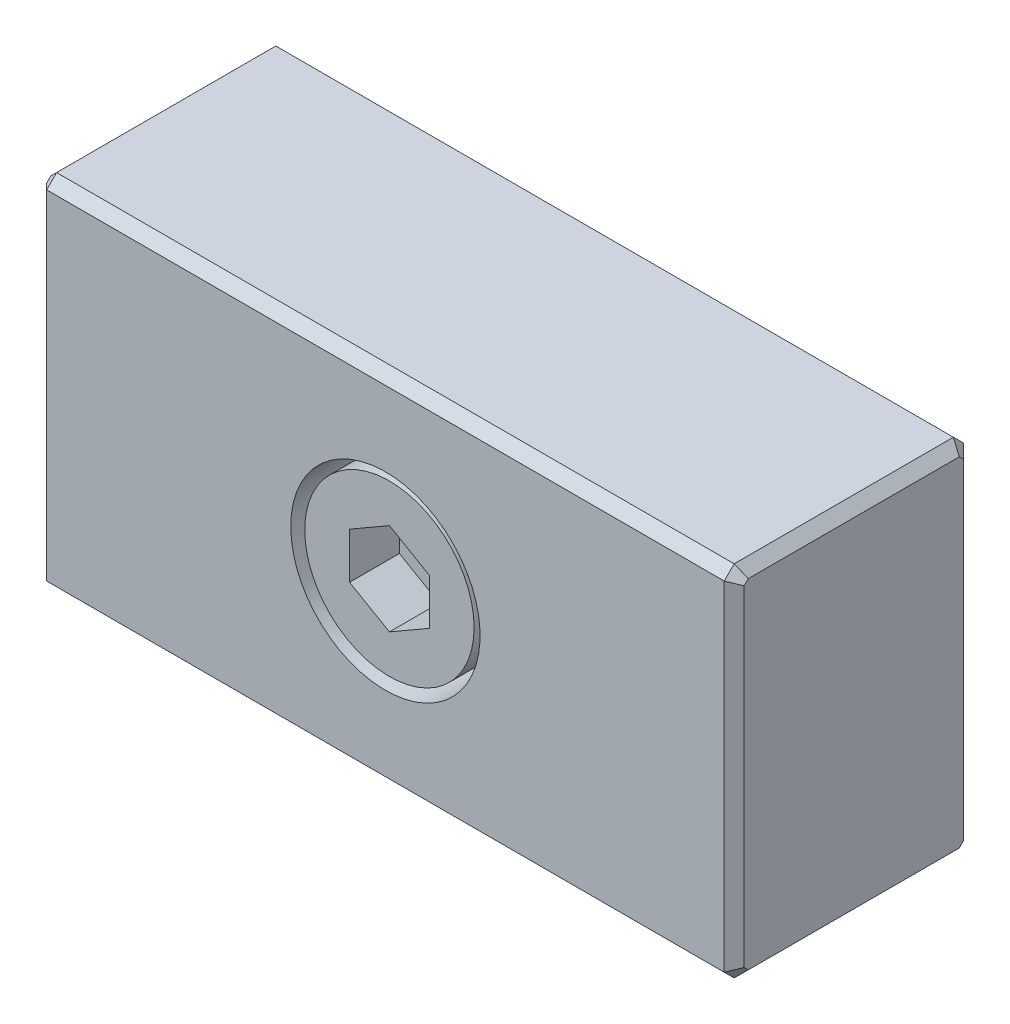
ISO-10303-21;
HEADER;
FILE_DESCRIPTION(('STEP AP214'),'2;1');
FILE_NAME('part.step','',(''),(''),'','','');
FILE_SCHEMA(('AUTOMOTIVE_DESIGN { 1 0 10303 214 1 1 1 1 }'));
ENDSEC;
DATA;
#1=APPLICATION_CONTEXT('core data for automotive mechanical design processes');
#2=APPLICATION_PROTOCOL_DEFINITION('international standard','automotive_design',2000,#1);
#3=PRODUCT_CONTEXT('',#1,'mechanical');
#4=PRODUCT('Part','Part','',(#3));
#5=PRODUCT_RELATED_PRODUCT_CATEGORY('part','',(#4));
#6=PRODUCT_DEFINITION_FORMATION('','',#4);
#7=PRODUCT_DEFINITION_CONTEXT('part definition',#1,'design');
#8=PRODUCT_DEFINITION('design','',#6,#7);
#9=PRODUCT_DEFINITION_SHAPE('','',#8);
#10=(LENGTH_UNIT() NAMED_UNIT(*) SI_UNIT(.MILLI.,.METRE.));
#11=(NAMED_UNIT(*) PLANE_ANGLE_UNIT() SI_UNIT($,.RADIAN.));
#12=(NAMED_UNIT(*) SI_UNIT($,.STERADIAN.) SOLID_ANGLE_UNIT());
#13=UNCERTAINTY_MEASURE_WITH_UNIT(LENGTH_MEASURE(1.E-05),#10,'distance_accuracy_value','');
#14=(GEOMETRIC_REPRESENTATION_CONTEXT(3) GLOBAL_UNCERTAINTY_ASSIGNED_CONTEXT((#13)) GLOBAL_UNIT_ASSIGNED_CONTEXT((#10,
#11,#12)) REPRESENTATION_CONTEXT('',''));
#15=CARTESIAN_POINT('',(0.,0.,0.));
#16=DIRECTION('',(0.,0.,1.));
#17=DIRECTION('',(1.,0.,0.));
#18=AXIS2_PLACEMENT_3D('',#15,#16,#17);
#19=CARTESIAN_POINT('',(17.5,6.5,12.));
#20=DIRECTION('',(0.,0.,-1.));
#21=DIRECTION('',(-1.,0.,0.));
#22=AXIS2_PLACEMENT_3D('',#19,#20,#21);
#23=PLANE('',#22);
#24=CARTESIAN_POINT('',(0.,0.,12.));
#25=DIRECTION('',(0.,0.,-1.));
#26=DIRECTION('',(-1.,0.,0.));
#27=AXIS2_PLACEMENT_3D('',#24,#25,#26);
#28=CIRCLE('',#27,4.75);
#29=CARTESIAN_POINT('',(-4.75,0.,12.));
#30=VERTEX_POINT('',#29);
#31=EDGE_CURVE('E367',#30,#30,#28,.T.);
#32=ORIENTED_EDGE('',*,*,#31,.T.);
#33=EDGE_LOOP('',(#32));
#34=FACE_BOUND('',#33,.T.);
#35=DIRECTION('',(1.,0.,0.));
#36=VECTOR('',#35,1.);
#37=CARTESIAN_POINT('',(-26.1878971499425,8.5,12.));
#38=LINE('',#37,#36);
#39=CARTESIAN_POINT('',(-17.,8.5,12.));
#40=VERTEX_POINT('',#39);
#41=CARTESIAN_POINT('',(17.,8.5,12.));
#42=VERTEX_POINT('',#41);
#43=EDGE_CURVE('E189',#40,#42,#38,.T.);
#44=ORIENTED_EDGE('',*,*,#43,.F.);
#45=DIRECTION('',(0.,-1.,0.));
#46=VECTOR('',#45,1.);
#47=CARTESIAN_POINT('',(-17.,-8.5,12.));
#48=LINE('',#47,#46);
#49=CARTESIAN_POINT('',(-17.,-8.5,12.));
#50=VERTEX_POINT('',#49);
#51=EDGE_CURVE('E269',#40,#50,#48,.T.);
#52=ORIENTED_EDGE('',*,*,#51,.T.);
#53=DIRECTION('',(1.,0.,0.));
#54=VECTOR('',#53,1.);
#55=CARTESIAN_POINT('',(-26.1878971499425,-8.5,12.));
#56=LINE('',#55,#54);
#57=CARTESIAN_POINT('',(17.,-8.5,12.));
#58=VERTEX_POINT('',#57);
#59=EDGE_CURVE('E765',#50,#58,#56,.T.);
#60=ORIENTED_EDGE('',*,*,#59,.T.);
#61=DIRECTION('',(0.,1.,0.));
#62=VECTOR('',#61,1.);
#63=CARTESIAN_POINT('',(17.,6.5,12.));
#64=LINE('',#63,#62);
#65=EDGE_CURVE('E267',#58,#42,#64,.T.);
#66=ORIENTED_EDGE('',*,*,#65,.T.);
#67=EDGE_LOOP('',(#44,#52,#60,#66));
#68=FACE_BOUND('',#67,.T.);
#69=ADVANCED_FACE('F14',(#34,#68),#23,.F.);
#70=CARTESIAN_POINT('',(17.5,-9.,4.8));
#71=DIRECTION('',(0.,1.,0.));
#72=DIRECTION('',(-1.,0.,0.));
#73=AXIS2_PLACEMENT_3D('',#70,#71,#72);
#74=PLANE('',#73);
#75=DIRECTION('',(1.,0.,0.));
#76=VECTOR('',#75,1.);
#77=CARTESIAN_POINT('',(-26.1878971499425,-9.,11.5));
#78=LINE('',#77,#76);
#79=CARTESIAN_POINT('',(-17.,-9.,11.5));
#80=VERTEX_POINT('',#79);
#81=CARTESIAN_POINT('',(17.,-9.,11.5));
#82=VERTEX_POINT('',#81);
#83=EDGE_CURVE('E318',#80,#82,#78,.T.);
#84=ORIENTED_EDGE('',*,*,#83,.F.);
#85=DIRECTION('',(0.,0.,-1.));
#86=VECTOR('',#85,1.);
#87=CARTESIAN_POINT('',(-17.,-9.,0.5));
#88=LINE('',#87,#86);
#89=CARTESIAN_POINT('',(-17.,-9.,0.5));
#90=VERTEX_POINT('',#89);
#91=EDGE_CURVE('E278',#80,#90,#88,.T.);
#92=ORIENTED_EDGE('',*,*,#91,.T.);
#93=DIRECTION('',(-1.,0.,0.));
#94=VECTOR('',#93,1.);
#95=CARTESIAN_POINT('',(17.5,-9.,0.5));
#96=LINE('',#95,#94);
#97=CARTESIAN_POINT('',(17.,-9.,0.5));
#98=VERTEX_POINT('',#97);
#99=EDGE_CURVE('E365',#98,#90,#96,.T.);
#100=ORIENTED_EDGE('',*,*,#99,.F.);
#101=DIRECTION('',(0.,0.,1.));
#102=VECTOR('',#101,1.);
#103=CARTESIAN_POINT('',(17.,-9.,4.8));
#104=LINE('',#103,#102);
#105=EDGE_CURVE('E276',#98,#82,#104,.T.);
#106=ORIENTED_EDGE('',*,*,#105,.T.);
#107=EDGE_LOOP('',(#84,#92,#100,#106));
#108=FACE_BOUND('',#107,.T.);
#109=ADVANCED_FACE('F710',(#108),#74,.F.);
#110=CARTESIAN_POINT('',(17.5,-9.,0.5));
#111=DIRECTION('',(0.,0.707106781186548,0.707106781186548));
#112=DIRECTION('',(0.,-0.707106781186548,0.707106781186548));
#113=AXIS2_PLACEMENT_3D('',#110,#111,#112);
#114=PLANE('',#113);
#115=ORIENTED_EDGE('',*,*,#99,.T.);
#116=DIRECTION('',(0.,0.707106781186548,-0.707106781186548));
#117=VECTOR('',#116,1.);
#118=CARTESIAN_POINT('',(-17.,-8.5,0.));
#119=LINE('',#118,#117);
#120=CARTESIAN_POINT('',(-17.,-8.5,0.));
#121=VERTEX_POINT('',#120);
#122=EDGE_CURVE('E282',#90,#121,#119,.T.);
#123=ORIENTED_EDGE('',*,*,#122,.T.);
#124=DIRECTION('',(-1.,0.,0.));
#125=VECTOR('',#124,1.);
#126=CARTESIAN_POINT('',(17.5,-8.5,0.));
#127=LINE('',#126,#125);
#128=CARTESIAN_POINT('',(17.,-8.5,0.));
#129=VERTEX_POINT('',#128);
#130=EDGE_CURVE('E363',#129,#121,#127,.T.);
#131=ORIENTED_EDGE('',*,*,#130,.F.);
#132=DIRECTION('',(0.,-0.707106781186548,0.707106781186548));
#133=VECTOR('',#132,1.);
#134=CARTESIAN_POINT('',(17.,-9.,0.5));
#135=LINE('',#134,#133);
#136=EDGE_CURVE('E280',#129,#98,#135,.T.);
#137=ORIENTED_EDGE('',*,*,#136,.T.);
#138=EDGE_LOOP('',(#115,#123,#131,#137));
#139=FACE_BOUND('',#138,.T.);
#140=ADVANCED_FACE('F701',(#139),#114,.F.);
#141=CARTESIAN_POINT('',(17.5,8.5,0.));
#142=DIRECTION('',(0.,0.,1.));
#143=DIRECTION('',(1.,0.,0.));
#144=AXIS2_PLACEMENT_3D('',#141,#142,#143);
#145=PLANE('',#144);
#146=CARTESIAN_POINT('',(0.,0.,0.));
#147=DIRECTION('',(0.,0.,-1.));
#148=DIRECTION('',(-1.,0.,0.));
#149=AXIS2_PLACEMENT_3D('',#146,#147,#148);
#150=CIRCLE('',#149,2.75);
#151=CARTESIAN_POINT('',(-2.75,0.,0.));
#152=VERTEX_POINT('',#151);
#153=EDGE_CURVE('E231',#152,#152,#150,.T.);
#154=ORIENTED_EDGE('',*,*,#153,.F.);
#155=EDGE_LOOP('',(#154));
#156=FACE_BOUND('',#155,.T.);
#157=ORIENTED_EDGE('',*,*,#130,.T.);
#158=DIRECTION('',(0.,1.,0.));
#159=VECTOR('',#158,1.);
#160=CARTESIAN_POINT('',(-17.,8.5,0.));
#161=LINE('',#160,#159);
#162=CARTESIAN_POINT('',(-17.,8.5,0.));
#163=VERTEX_POINT('',#162);
#164=EDGE_CURVE('E234',#121,#163,#161,.T.);
#165=ORIENTED_EDGE('',*,*,#164,.T.);
#166=DIRECTION('',(-1.,0.,0.));
#167=VECTOR('',#166,1.);
#168=CARTESIAN_POINT('',(17.5,8.5,0.));
#169=LINE('',#168,#167);
#170=CARTESIAN_POINT('',(17.,8.5,0.));
#171=VERTEX_POINT('',#170);
#172=EDGE_CURVE('E355',#171,#163,#169,.T.);
#173=ORIENTED_EDGE('',*,*,#172,.F.);
#174=DIRECTION('',(0.,-1.,0.));
#175=VECTOR('',#174,1.);
#176=CARTESIAN_POINT('',(17.,8.5,0.));
#177=LINE('',#176,#175);
#178=EDGE_CURVE('E232',#171,#129,#177,.T.);
#179=ORIENTED_EDGE('',*,*,#178,.T.);
#180=EDGE_LOOP('',(#157,#165,#173,#179));
#181=FACE_BOUND('',#180,.T.);
#182=ADVANCED_FACE('F360',(#156,#181),#145,.F.);
#183=CARTESIAN_POINT('',(17.5,9.,0.5));
#184=DIRECTION('',(0.,-0.707106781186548,0.707106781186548));
#185=DIRECTION('',(0.,-0.707106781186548,-0.707106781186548));
#186=AXIS2_PLACEMENT_3D('',#183,#184,#185);
#187=PLANE('',#186);
#188=ORIENTED_EDGE('',*,*,#172,.T.);
#189=DIRECTION('',(0.,0.707106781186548,0.707106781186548));
#190=VECTOR('',#189,1.);
#191=CARTESIAN_POINT('',(-17.,9.,0.5));
#192=LINE('',#191,#190);
#193=CARTESIAN_POINT('',(-17.,9.,0.5));
#194=VERTEX_POINT('',#193);
#195=EDGE_CURVE('E257',#163,#194,#192,.T.);
#196=ORIENTED_EDGE('',*,*,#195,.T.);
#197=DIRECTION('',(-1.,0.,0.));
#198=VECTOR('',#197,1.);
#199=CARTESIAN_POINT('',(17.5,9.,0.5));
#200=LINE('',#199,#198);
#201=CARTESIAN_POINT('',(17.,9.,0.5));
#202=VERTEX_POINT('',#201);
#203=EDGE_CURVE('E357',#202,#194,#200,.T.);
#204=ORIENTED_EDGE('',*,*,#203,.F.);
#205=DIRECTION('',(0.,-0.707106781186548,-0.707106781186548));
#206=VECTOR('',#205,1.);
#207=CARTESIAN_POINT('',(17.,9.,0.5));
#208=LINE('',#207,#206);
#209=EDGE_CURVE('E255',#202,#171,#208,.T.);
#210=ORIENTED_EDGE('',*,*,#209,.T.);
#211=EDGE_LOOP('',(#188,#196,#204,#210));
#212=FACE_BOUND('',#211,.T.);
#213=ADVANCED_FACE('F354',(#212),#187,.F.);
#214=CARTESIAN_POINT('',(17.5,9.,4.8));
#215=DIRECTION('',(0.,-1.,0.));
#216=DIRECTION('',(1.,0.,0.));
#217=AXIS2_PLACEMENT_3D('',#214,#215,#216);
#218=PLANE('',#217);
#219=ORIENTED_EDGE('',*,*,#203,.T.);
#220=DIRECTION('',(0.,0.,1.));
#221=VECTOR('',#220,1.);
#222=CARTESIAN_POINT('',(-17.,9.,11.5));
#223=LINE('',#222,#221);
#224=CARTESIAN_POINT('',(-17.,9.,11.5));
#225=VERTEX_POINT('',#224);
#226=EDGE_CURVE('E261',#194,#225,#223,.T.);
#227=ORIENTED_EDGE('',*,*,#226,.T.);
#228=DIRECTION('',(1.,0.,0.));
#229=VECTOR('',#228,1.);
#230=CARTESIAN_POINT('',(-26.1878971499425,9.,11.5));
#231=LINE('',#230,#229);
#232=CARTESIAN_POINT('',(17.,9.,11.5));
#233=VERTEX_POINT('',#232);
#234=EDGE_CURVE('E192',#225,#233,#231,.T.);
#235=ORIENTED_EDGE('',*,*,#234,.T.);
#236=DIRECTION('',(0.,0.,-1.));
#237=VECTOR('',#236,1.);
#238=CARTESIAN_POINT('',(17.,9.,4.8));
#239=LINE('',#238,#237);
#240=EDGE_CURVE('E259',#233,#202,#239,.T.);
#241=ORIENTED_EDGE('',*,*,#240,.T.);
#242=EDGE_LOOP('',(#219,#227,#235,#241));
#243=FACE_BOUND('',#242,.T.);
#244=ADVANCED_FACE('F678',(#243),#218,.F.);
#245=CARTESIAN_POINT('',(17.5,13.5,5.00000000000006));
#246=DIRECTION('',(-1.,0.,0.));
#247=DIRECTION('',(0.,-1.,0.));
#248=AXIS2_PLACEMENT_3D('',#245,#246,#247);
#249=PLANE('',#248);
#250=DIRECTION('',(0.,-1.,0.));
#251=VECTOR('',#250,1.);
#252=CARTESIAN_POINT('',(17.5,13.5,11.5));
#253=LINE('',#252,#251);
#254=CARTESIAN_POINT('',(17.5,8.29289321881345,11.5));
#255=VERTEX_POINT('',#254);
#256=CARTESIAN_POINT('',(17.5,-8.29289321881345,11.5));
#257=VERTEX_POINT('',#256);
#258=EDGE_CURVE('E23',#255,#257,#253,.T.);
#259=ORIENTED_EDGE('',*,*,#258,.T.);
#260=DIRECTION('',(0.,-0.707106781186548,-0.707106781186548));
#261=VECTOR('',#260,1.);
#262=CARTESIAN_POINT('',(17.5,-8.64644660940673,11.1464466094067));
#263=LINE('',#262,#261);
#264=CARTESIAN_POINT('',(17.5,-8.5,11.2928932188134));
#265=VERTEX_POINT('',#264);
#266=EDGE_CURVE('E9',#257,#265,#263,.T.);
#267=ORIENTED_EDGE('',*,*,#266,.T.);
#268=DIRECTION('',(0.,0.,-1.));
#269=VECTOR('',#268,1.);
#270=CARTESIAN_POINT('',(17.5,-8.5,5.00000000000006));
#271=LINE('',#270,#269);
#272=CARTESIAN_POINT('',(17.5,-8.5,0.707106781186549));
#273=VERTEX_POINT('',#272);
#274=EDGE_CURVE('E284',#265,#273,#271,.T.);
#275=ORIENTED_EDGE('',*,*,#274,.T.);
#276=DIRECTION('',(0.,0.707106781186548,-0.707106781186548));
#277=VECTOR('',#276,1.);
#278=CARTESIAN_POINT('',(17.5,0.353553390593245,-8.1464466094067));
#279=LINE('',#278,#277);
#280=CARTESIAN_POINT('',(17.5,-8.29289321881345,0.5));
#281=VERTEX_POINT('',#280);
#282=EDGE_CURVE('E286',#273,#281,#279,.T.);
#283=ORIENTED_EDGE('',*,*,#282,.T.);
#284=DIRECTION('',(0.,1.,0.));
#285=VECTOR('',#284,1.);
#286=CARTESIAN_POINT('',(17.5,13.5,0.5));
#287=LINE('',#286,#285);
#288=CARTESIAN_POINT('',(17.5,8.29289321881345,0.5));
#289=VERTEX_POINT('',#288);
#290=EDGE_CURVE('E288',#281,#289,#287,.T.);
#291=ORIENTED_EDGE('',*,*,#290,.T.);
#292=DIRECTION('',(0.,0.707106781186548,0.707106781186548));
#293=VECTOR('',#292,1.);
#294=CARTESIAN_POINT('',(17.5,13.1464466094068,5.3535533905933));
#295=LINE('',#294,#293);
#296=CARTESIAN_POINT('',(17.5,8.5,0.707106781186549));
#297=VERTEX_POINT('',#296);
#298=EDGE_CURVE('E290',#289,#297,#295,.T.);
#299=ORIENTED_EDGE('',*,*,#298,.T.);
#300=DIRECTION('',(0.,0.,1.));
#301=VECTOR('',#300,1.);
#302=CARTESIAN_POINT('',(17.5,8.5,5.00000000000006));
#303=LINE('',#302,#301);
#304=CARTESIAN_POINT('',(17.5,8.5,11.2928932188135));
#305=VERTEX_POINT('',#304);
#306=EDGE_CURVE('E292',#297,#305,#303,.T.);
#307=ORIENTED_EDGE('',*,*,#306,.T.);
#308=DIRECTION('',(0.,-0.707106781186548,0.707106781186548));
#309=VECTOR('',#308,1.);
#310=CARTESIAN_POINT('',(17.5,8.14644660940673,11.6464466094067));
#311=LINE('',#310,#309);
#312=EDGE_CURVE('E34',#305,#255,#311,.T.);
#313=ORIENTED_EDGE('',*,*,#312,.T.);
#314=EDGE_LOOP('',(#259,#267,#275,#283,#291,#299,#307,#313));
#315=FACE_BOUND('',#314,.T.);
#316=ADVANCED_FACE('F669',(#315),#249,.F.);
#317=CARTESIAN_POINT('',(-17.5,13.5,5.00000000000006));
#318=DIRECTION('',(-1.,0.,0.));
#319=DIRECTION('',(0.,-1.,0.));
#320=AXIS2_PLACEMENT_3D('',#317,#318,#319);
#321=PLANE('',#320);
#322=DIRECTION('',(0.,-0.707106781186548,-0.707106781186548));
#323=VECTOR('',#322,1.);
#324=CARTESIAN_POINT('',(-17.5,8.14644660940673,0.353553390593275));
#325=LINE('',#324,#323);
#326=CARTESIAN_POINT('',(-17.5,8.5,0.707106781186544));
#327=VERTEX_POINT('',#326);
#328=CARTESIAN_POINT('',(-17.5,8.29289321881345,0.5));
#329=VERTEX_POINT('',#328);
#330=EDGE_CURVE('E250',#327,#329,#325,.T.);
#331=ORIENTED_EDGE('',*,*,#330,.T.);
#332=DIRECTION('',(0.,-1.,0.));
#333=VECTOR('',#332,1.);
#334=CARTESIAN_POINT('',(-17.5,-8.5,0.5));
#335=LINE('',#334,#333);
#336=CARTESIAN_POINT('',(-17.5,-8.29289321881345,0.5));
#337=VERTEX_POINT('',#336);
#338=EDGE_CURVE('E252',#329,#337,#335,.T.);
#339=ORIENTED_EDGE('',*,*,#338,.T.);
#340=DIRECTION('',(0.,-0.707106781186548,0.707106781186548));
#341=VECTOR('',#340,1.);
#342=CARTESIAN_POINT('',(-17.5,-8.64644660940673,0.853553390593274));
#343=LINE('',#342,#341);
#344=CARTESIAN_POINT('',(-17.5,-8.5,0.707106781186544));
#345=VERTEX_POINT('',#344);
#346=EDGE_CURVE('E238',#337,#345,#343,.T.);
#347=ORIENTED_EDGE('',*,*,#346,.T.);
#348=DIRECTION('',(0.,0.,1.));
#349=VECTOR('',#348,1.);
#350=CARTESIAN_POINT('',(-17.5,-8.5,11.5));
#351=LINE('',#350,#349);
#352=CARTESIAN_POINT('',(-17.5,-8.5,11.2928932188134));
#353=VERTEX_POINT('',#352);
#354=EDGE_CURVE('E240',#345,#353,#351,.T.);
#355=ORIENTED_EDGE('',*,*,#354,.T.);
#356=DIRECTION('',(0.,0.707106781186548,0.707106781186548));
#357=VECTOR('',#356,1.);
#358=CARTESIAN_POINT('',(-17.5,-0.646446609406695,19.1464466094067));
#359=LINE('',#358,#357);
#360=CARTESIAN_POINT('',(-17.5,-8.29289321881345,11.5));
#361=VERTEX_POINT('',#360);
#362=EDGE_CURVE('E242',#353,#361,#359,.T.);
#363=ORIENTED_EDGE('',*,*,#362,.T.);
#364=DIRECTION('',(0.,1.,0.));
#365=VECTOR('',#364,1.);
#366=CARTESIAN_POINT('',(-17.5,8.5,11.5));
#367=LINE('',#366,#365);
#368=CARTESIAN_POINT('',(-17.5,8.29289321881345,11.5));
#369=VERTEX_POINT('',#368);
#370=EDGE_CURVE('E244',#361,#369,#367,.T.);
#371=ORIENTED_EDGE('',*,*,#370,.T.);
#372=DIRECTION('',(0.,0.707106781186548,-0.707106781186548));
#373=VECTOR('',#372,1.);
#374=CARTESIAN_POINT('',(-17.5,14.1464466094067,5.64644660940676));
#375=LINE('',#374,#373);
#376=CARTESIAN_POINT('',(-17.5,8.5,11.2928932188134));
#377=VERTEX_POINT('',#376);
#378=EDGE_CURVE('E246',#369,#377,#375,.T.);
#379=ORIENTED_EDGE('',*,*,#378,.T.);
#380=DIRECTION('',(0.,0.,-1.));
#381=VECTOR('',#380,1.);
#382=CARTESIAN_POINT('',(-17.5,8.5,0.5));
#383=LINE('',#382,#381);
#384=EDGE_CURVE('E248',#377,#327,#383,.T.);
#385=ORIENTED_EDGE('',*,*,#384,.T.);
#386=EDGE_LOOP('',(#331,#339,#347,#355,#363,#371,#379,#385));
#387=FACE_BOUND('',#386,.T.);
#388=ADVANCED_FACE('F660',(#387),#321,.T.);
#389=CARTESIAN_POINT('',(0.,0.,0.));
#390=DIRECTION('',(0.,0.,-1.));
#391=DIRECTION('',(-1.,0.,0.));
#392=AXIS2_PLACEMENT_3D('',#389,#390,#391);
#393=CYLINDRICAL_SURFACE('',#392,4.75);
#394=ORIENTED_EDGE('',*,*,#31,.F.);
#395=EDGE_LOOP('',(#394));
#396=FACE_BOUND('',#395,.T.);
#397=CARTESIAN_POINT('',(0.,0.,6.8));
#398=DIRECTION('',(0.,0.,-1.));
#399=DIRECTION('',(-1.,0.,0.));
#400=AXIS2_PLACEMENT_3D('',#397,#398,#399);
#401=CIRCLE('',#400,4.75);
#402=CARTESIAN_POINT('',(-4.75,0.,6.8));
#403=VERTEX_POINT('',#402);
#404=EDGE_CURVE('E778',#403,#403,#401,.T.);
#405=ORIENTED_EDGE('',*,*,#404,.T.);
#406=EDGE_LOOP('',(#405));
#407=FACE_BOUND('',#406,.T.);
#408=ADVANCED_FACE('F651',(#396,#407),#393,.F.);
#409=CARTESIAN_POINT('',(0.,4.75,6.8));
#410=DIRECTION('',(0.,0.,-1.));
#411=DIRECTION('',(-1.,0.,0.));
#412=AXIS2_PLACEMENT_3D('',#409,#410,#411);
#413=PLANE('',#412);
#414=CARTESIAN_POINT('',(0.,0.,6.8));
#415=DIRECTION('',(0.,0.,-1.));
#416=DIRECTION('',(-1.,0.,0.));
#417=AXIS2_PLACEMENT_3D('',#414,#415,#416);
#418=CIRCLE('',#417,4.25);
#419=CARTESIAN_POINT('',(-4.25,0.,6.8));
#420=VERTEX_POINT('',#419);
#421=EDGE_CURVE('E235',#420,#420,#418,.T.);
#422=ORIENTED_EDGE('',*,*,#421,.T.);
#423=EDGE_LOOP('',(#422));
#424=FACE_BOUND('',#423,.T.);
#425=ORIENTED_EDGE('',*,*,#404,.F.);
#426=EDGE_LOOP('',(#425));
#427=FACE_BOUND('',#426,.T.);
#428=ADVANCED_FACE('F643',(#424,#427),#413,.F.);
#429=CARTESIAN_POINT('',(0.,0.,0.));
#430=DIRECTION('',(0.,0.,-1.));
#431=DIRECTION('',(-1.,0.,0.));
#432=AXIS2_PLACEMENT_3D('',#429,#430,#431);
#433=CYLINDRICAL_SURFACE('',#432,2.75);
#434=CARTESIAN_POINT('',(0.,0.,6.8));
#435=DIRECTION('',(0.,0.,-1.));
#436=DIRECTION('',(-1.,0.,0.));
#437=AXIS2_PLACEMENT_3D('',#434,#435,#436);
#438=CIRCLE('',#437,2.75);
#439=CARTESIAN_POINT('',(-2.75,0.,6.8));
#440=VERTEX_POINT('',#439);
#441=EDGE_CURVE('E775',#440,#440,#438,.T.);
#442=ORIENTED_EDGE('',*,*,#441,.F.);
#443=EDGE_LOOP('',(#442));
#444=FACE_BOUND('',#443,.T.);
#445=ORIENTED_EDGE('',*,*,#153,.T.);
#446=EDGE_LOOP('',(#445));
#447=FACE_BOUND('',#446,.T.);
#448=ADVANCED_FACE('F425',(#444,#447),#433,.F.);
#449=CARTESIAN_POINT('',(2.5,0.,-5.2));
#450=DIRECTION('',(0.,0.,-1.));
#451=DIRECTION('',(-1.,0.,0.));
#452=AXIS2_PLACEMENT_3D('',#449,#450,#451);
#453=PLANE('',#452);
#454=CARTESIAN_POINT('',(0.,0.,-5.2));
#455=DIRECTION('',(0.,0.,-1.));
#456=DIRECTION('',(-1.,0.,0.));
#457=AXIS2_PLACEMENT_3D('',#454,#455,#456);
#458=CIRCLE('',#457,1.6);
#459=CARTESIAN_POINT('',(-1.6,0.,-5.2));
#460=VERTEX_POINT('',#459);
#461=EDGE_CURVE('E228',#460,#460,#458,.T.);
#462=ORIENTED_EDGE('',*,*,#461,.T.);
#463=EDGE_LOOP('',(#462));
#464=FACE_BOUND('',#463,.T.);
#465=ADVANCED_FACE('F415',(#464),#453,.T.);
#466=CARTESIAN_POINT('',(0.,0.,-4.3));
#467=DIRECTION('',(0.,0.,1.));
#468=DIRECTION('',(1.,0.,0.));
#469=AXIS2_PLACEMENT_3D('',#466,#467,#468);
#470=CONICAL_SURFACE('',#469,2.5,0.785398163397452);
#471=ORIENTED_EDGE('',*,*,#461,.F.);
#472=EDGE_LOOP('',(#471));
#473=FACE_BOUND('',#472,.T.);
#474=CARTESIAN_POINT('',(0.,0.,-4.3));
#475=DIRECTION('',(0.,0.,-1.));
#476=DIRECTION('',(-1.,0.,0.));
#477=AXIS2_PLACEMENT_3D('',#474,#475,#476);
#478=CIRCLE('',#477,2.5);
#479=CARTESIAN_POINT('',(-2.5,0.,-4.3));
#480=VERTEX_POINT('',#479);
#481=EDGE_CURVE('E225',#480,#480,#478,.F.);
#482=ORIENTED_EDGE('',*,*,#481,.F.);
#483=EDGE_LOOP('',(#482));
#484=FACE_BOUND('',#483,.T.);
#485=ADVANCED_FACE('F413',(#473,#484),#470,.T.);
#486=CARTESIAN_POINT('',(0.,0.,14.8));
#487=DIRECTION('',(0.,0.,1.));
#488=DIRECTION('',(1.,0.,0.));
#489=AXIS2_PLACEMENT_3D('',#486,#487,#488);
#490=CYLINDRICAL_SURFACE('',#489,2.5);
#491=ORIENTED_EDGE('',*,*,#481,.T.);
#492=EDGE_LOOP('',(#491));
#493=FACE_BOUND('',#492,.T.);
#494=CARTESIAN_POINT('',(0.,0.,6.8));
#495=DIRECTION('',(0.,0.,1.));
#496=DIRECTION('',(1.,0.,0.));
#497=AXIS2_PLACEMENT_3D('',#494,#495,#496);
#498=CIRCLE('',#497,2.5);
#499=CARTESIAN_POINT('',(2.5,0.,6.8));
#500=VERTEX_POINT('',#499);
#501=EDGE_CURVE('E173',#500,#500,#498,.T.);
#502=ORIENTED_EDGE('',*,*,#501,.F.);
#503=EDGE_LOOP('',(#502));
#504=FACE_BOUND('',#503,.T.);
#505=ADVANCED_FACE('F406',(#493,#504),#490,.T.);
#506=CARTESIAN_POINT('',(4.25,0.,6.8));
#507=DIRECTION('',(0.,0.,-1.));
#508=DIRECTION('',(-1.,0.,0.));
#509=AXIS2_PLACEMENT_3D('',#506,#507,#508);
#510=PLANE('',#509);
#511=ORIENTED_EDGE('',*,*,#501,.T.);
#512=EDGE_LOOP('',(#511));
#513=FACE_BOUND('',#512,.T.);
#514=ORIENTED_EDGE('',*,*,#441,.T.);
#515=EDGE_LOOP('',(#514));
#516=FACE_BOUND('',#515,.T.);
#517=ADVANCED_FACE('F397',(#513,#516),#510,.T.);
#518=CARTESIAN_POINT('',(-2.,3.46410161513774,9.3));
#519=DIRECTION('',(0.,0.,-1.));
#520=DIRECTION('',(-1.,0.,0.));
#521=AXIS2_PLACEMENT_3D('',#518,#519,#520);
#522=PLANE('',#521);
#523=DIRECTION('',(0.86602540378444,-0.5,0.));
#524=VECTOR('',#523,1.);
#525=CARTESIAN_POINT('',(0.,2.3094010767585,9.3));
#526=LINE('',#525,#524);
#527=CARTESIAN_POINT('',(0.,2.3094010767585,9.3));
#528=VERTEX_POINT('',#527);
#529=CARTESIAN_POINT('',(2.,1.15470053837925,9.3));
#530=VERTEX_POINT('',#529);
#531=EDGE_CURVE('E169',#528,#530,#526,.T.);
#532=ORIENTED_EDGE('',*,*,#531,.F.);
#533=DIRECTION('',(-0.86602540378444,-0.5,0.));
#534=VECTOR('',#533,1.);
#535=CARTESIAN_POINT('',(0.,2.3094010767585,9.3));
#536=LINE('',#535,#534);
#537=CARTESIAN_POINT('',(-2.,1.15470053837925,9.3));
#538=VERTEX_POINT('',#537);
#539=EDGE_CURVE('E196',#528,#538,#536,.T.);
#540=ORIENTED_EDGE('',*,*,#539,.T.);
#541=DIRECTION('',(0.,-1.,0.));
#542=VECTOR('',#541,1.);
#543=CARTESIAN_POINT('',(-2.,1.15470053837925,9.3));
#544=LINE('',#543,#542);
#545=CARTESIAN_POINT('',(-2.,-1.15470053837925,9.3));
#546=VERTEX_POINT('',#545);
#547=EDGE_CURVE('E200',#538,#546,#544,.T.);
#548=ORIENTED_EDGE('',*,*,#547,.T.);
#549=DIRECTION('',(-0.86602540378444,0.5,0.));
#550=VECTOR('',#549,1.);
#551=CARTESIAN_POINT('',(0.,-2.3094010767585,9.3));
#552=LINE('',#551,#550);
#553=CARTESIAN_POINT('',(0.,-2.3094010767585,9.3));
#554=VERTEX_POINT('',#553);
#555=EDGE_CURVE('E203',#554,#546,#552,.T.);
#556=ORIENTED_EDGE('',*,*,#555,.F.);
#557=DIRECTION('',(0.86602540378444,0.5,0.));
#558=VECTOR('',#557,1.);
#559=CARTESIAN_POINT('',(0.,-2.3094010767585,9.3));
#560=LINE('',#559,#558);
#561=CARTESIAN_POINT('',(2.,-1.15470053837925,9.3));
#562=VERTEX_POINT('',#561);
#563=EDGE_CURVE('E206',#554,#562,#560,.T.);
#564=ORIENTED_EDGE('',*,*,#563,.T.);
#565=DIRECTION('',(0.,1.,0.));
#566=VECTOR('',#565,1.);
#567=CARTESIAN_POINT('',(2.,-1.15470053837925,9.3));
#568=LINE('',#567,#566);
#569=EDGE_CURVE('E209',#562,#530,#568,.T.);
#570=ORIENTED_EDGE('',*,*,#569,.T.);
#571=EDGE_LOOP('',(#532,#540,#548,#556,#564,#570));
#572=FACE_BOUND('',#571,.T.);
#573=ADVANCED_FACE('F395',(#572),#522,.F.);
#574=CARTESIAN_POINT('',(-2.,1.15470053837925,9.3));
#575=DIRECTION('',(-1.,0.,0.));
#576=DIRECTION('',(0.,-1.,0.));
#577=AXIS2_PLACEMENT_3D('',#574,#575,#576);
#578=PLANE('',#577);
#579=DIRECTION('',(0.,0.,1.));
#580=VECTOR('',#579,1.);
#581=CARTESIAN_POINT('',(-2.,1.15470053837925,9.3));
#582=LINE('',#581,#580);
#583=CARTESIAN_POINT('',(-2.,1.15470053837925,11.8));
#584=VERTEX_POINT('',#583);
#585=EDGE_CURVE('E213',#538,#584,#582,.T.);
#586=ORIENTED_EDGE('',*,*,#585,.T.);
#587=DIRECTION('',(0.,-1.,0.));
#588=VECTOR('',#587,1.);
#589=CARTESIAN_POINT('',(-2.,1.15470053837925,11.8));
#590=LINE('',#589,#588);
#591=CARTESIAN_POINT('',(-2.,-1.15470053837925,11.8));
#592=VERTEX_POINT('',#591);
#593=EDGE_CURVE('E376',#584,#592,#590,.T.);
#594=ORIENTED_EDGE('',*,*,#593,.T.);
#595=DIRECTION('',(0.,0.,1.));
#596=VECTOR('',#595,1.);
#597=CARTESIAN_POINT('',(-2.,-1.15470053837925,9.3));
#598=LINE('',#597,#596);
#599=EDGE_CURVE('E215',#546,#592,#598,.T.);
#600=ORIENTED_EDGE('',*,*,#599,.F.);
#601=ORIENTED_EDGE('',*,*,#547,.F.);
#602=EDGE_LOOP('',(#586,#594,#600,#601));
#603=FACE_BOUND('',#602,.T.);
#604=ADVANCED_FACE('F390',(#603),#578,.F.);
#605=CARTESIAN_POINT('',(0.,-2.3094010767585,9.3));
#606=DIRECTION('',(0.5,0.86602540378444,0.));
#607=DIRECTION('',(-0.86602540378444,0.5,0.));
#608=AXIS2_PLACEMENT_3D('',#605,#606,#607);
#609=PLANE('',#608);
#610=ORIENTED_EDGE('',*,*,#599,.T.);
#611=DIRECTION('',(-0.86602540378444,0.5,0.));
#612=VECTOR('',#611,1.);
#613=CARTESIAN_POINT('',(0.,-2.3094010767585,11.8));
#614=LINE('',#613,#612);
#615=CARTESIAN_POINT('',(0.,-2.3094010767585,11.8));
#616=VERTEX_POINT('',#615);
#617=EDGE_CURVE('E379',#616,#592,#614,.T.);
#618=ORIENTED_EDGE('',*,*,#617,.F.);
#619=DIRECTION('',(0.,0.,1.));
#620=VECTOR('',#619,1.);
#621=CARTESIAN_POINT('',(0.,-2.3094010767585,9.3));
#622=LINE('',#621,#620);
#623=EDGE_CURVE('E217',#554,#616,#622,.T.);
#624=ORIENTED_EDGE('',*,*,#623,.F.);
#625=ORIENTED_EDGE('',*,*,#555,.T.);
#626=EDGE_LOOP('',(#610,#618,#624,#625));
#627=FACE_BOUND('',#626,.T.);
#628=ADVANCED_FACE('F386',(#627),#609,.T.);
#629=CARTESIAN_POINT('',(0.,-2.3094010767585,9.3));
#630=DIRECTION('',(0.5,-0.86602540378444,0.));
#631=DIRECTION('',(0.86602540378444,0.5,0.));
#632=AXIS2_PLACEMENT_3D('',#629,#630,#631);
#633=PLANE('',#632);
#634=ORIENTED_EDGE('',*,*,#623,.T.);
#635=DIRECTION('',(0.86602540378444,0.5,0.));
#636=VECTOR('',#635,1.);
#637=CARTESIAN_POINT('',(0.,-2.3094010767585,11.8));
#638=LINE('',#637,#636);
#639=CARTESIAN_POINT('',(2.,-1.15470053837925,11.8));
#640=VERTEX_POINT('',#639);
#641=EDGE_CURVE('E182',#616,#640,#638,.T.);
#642=ORIENTED_EDGE('',*,*,#641,.T.);
#643=DIRECTION('',(0.,0.,1.));
#644=VECTOR('',#643,1.);
#645=CARTESIAN_POINT('',(2.,-1.15470053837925,9.3));
#646=LINE('',#645,#644);
#647=EDGE_CURVE('E174',#562,#640,#646,.T.);
#648=ORIENTED_EDGE('',*,*,#647,.F.);
#649=ORIENTED_EDGE('',*,*,#563,.F.);
#650=EDGE_LOOP('',(#634,#642,#648,#649));
#651=FACE_BOUND('',#650,.T.);
#652=ADVANCED_FACE('F382',(#651),#633,.F.);
#653=CARTESIAN_POINT('',(2.,-1.15470053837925,9.3));
#654=DIRECTION('',(1.,0.,0.));
#655=DIRECTION('',(0.,0.,-1.));
#656=AXIS2_PLACEMENT_3D('',#653,#654,#655);
#657=PLANE('',#656);
#658=ORIENTED_EDGE('',*,*,#647,.T.);
#659=DIRECTION('',(0.,1.,0.));
#660=VECTOR('',#659,1.);
#661=CARTESIAN_POINT('',(2.,-1.15470053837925,11.8));
#662=LINE('',#661,#660);
#663=CARTESIAN_POINT('',(2.,1.15470053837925,11.8));
#664=VERTEX_POINT('',#663);
#665=EDGE_CURVE('E177',#640,#664,#662,.T.);
#666=ORIENTED_EDGE('',*,*,#665,.T.);
#667=DIRECTION('',(0.,0.,1.));
#668=VECTOR('',#667,1.);
#669=CARTESIAN_POINT('',(2.,1.15470053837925,9.3));
#670=LINE('',#669,#668);
#671=EDGE_CURVE('E162',#530,#664,#670,.T.);
#672=ORIENTED_EDGE('',*,*,#671,.F.);
#673=ORIENTED_EDGE('',*,*,#569,.F.);
#674=EDGE_LOOP('',(#658,#666,#672,#673));
#675=FACE_BOUND('',#674,.T.);
#676=ADVANCED_FACE('F178',(#675),#657,.F.);
#677=CARTESIAN_POINT('',(0.,2.3094010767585,9.3));
#678=DIRECTION('',(-0.5,-0.86602540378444,0.));
#679=DIRECTION('',(0.86602540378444,-0.5,0.));
#680=AXIS2_PLACEMENT_3D('',#677,#678,#679);
#681=PLANE('',#680);
#682=ORIENTED_EDGE('',*,*,#671,.T.);
#683=DIRECTION('',(0.86602540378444,-0.5,0.));
#684=VECTOR('',#683,1.);
#685=CARTESIAN_POINT('',(0.,2.3094010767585,11.8));
#686=LINE('',#685,#684);
#687=CARTESIAN_POINT('',(0.,2.3094010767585,11.8));
#688=VERTEX_POINT('',#687);
#689=EDGE_CURVE('E166',#688,#664,#686,.T.);
#690=ORIENTED_EDGE('',*,*,#689,.F.);
#691=DIRECTION('',(0.,0.,1.));
#692=VECTOR('',#691,1.);
#693=CARTESIAN_POINT('',(0.,2.3094010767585,9.3));
#694=LINE('',#693,#692);
#695=EDGE_CURVE('E199',#528,#688,#694,.T.);
#696=ORIENTED_EDGE('',*,*,#695,.F.);
#697=ORIENTED_EDGE('',*,*,#531,.T.);
#698=EDGE_LOOP('',(#682,#690,#696,#697));
#699=FACE_BOUND('',#698,.T.);
#700=ADVANCED_FACE('F164',(#699),#681,.T.);
#701=CARTESIAN_POINT('',(0.,2.3094010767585,9.3));
#702=DIRECTION('',(-0.5,0.86602540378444,0.));
#703=DIRECTION('',(-0.86602540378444,-0.5,0.));
#704=AXIS2_PLACEMENT_3D('',#701,#702,#703);
#705=PLANE('',#704);
#706=ORIENTED_EDGE('',*,*,#539,.F.);
#707=ORIENTED_EDGE('',*,*,#695,.T.);
#708=DIRECTION('',(-0.86602540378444,-0.5,0.));
#709=VECTOR('',#708,1.);
#710=CARTESIAN_POINT('',(0.,2.3094010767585,11.8));
#711=LINE('',#710,#709);
#712=EDGE_CURVE('E188',#688,#584,#711,.T.);
#713=ORIENTED_EDGE('',*,*,#712,.T.);
#714=ORIENTED_EDGE('',*,*,#585,.F.);
#715=EDGE_LOOP('',(#706,#707,#713,#714));
#716=FACE_BOUND('',#715,.T.);
#717=ADVANCED_FACE('F393',(#716),#705,.F.);
#718=CARTESIAN_POINT('',(0.,0.,11.8));
#719=DIRECTION('',(0.,0.,1.));
#720=DIRECTION('',(1.,0.,0.));
#721=AXIS2_PLACEMENT_3D('',#718,#719,#720);
#722=PLANE('',#721);
#723=CARTESIAN_POINT('',(0.,0.,11.8));
#724=DIRECTION('',(0.,0.,1.));
#725=DIRECTION('',(1.,0.,0.));
#726=AXIS2_PLACEMENT_3D('',#723,#724,#725);
#727=CIRCLE('',#726,4.25);
#728=CARTESIAN_POINT('',(4.25,0.,11.8));
#729=VERTEX_POINT('',#728);
#730=EDGE_CURVE('E222',#729,#729,#727,.T.);
#731=ORIENTED_EDGE('',*,*,#730,.T.);
#732=EDGE_LOOP('',(#731));
#733=FACE_BOUND('',#732,.T.);
#734=ORIENTED_EDGE('',*,*,#712,.F.);
#735=ORIENTED_EDGE('',*,*,#689,.T.);
#736=ORIENTED_EDGE('',*,*,#665,.F.);
#737=ORIENTED_EDGE('',*,*,#641,.F.);
#738=ORIENTED_EDGE('',*,*,#617,.T.);
#739=ORIENTED_EDGE('',*,*,#593,.F.);
#740=EDGE_LOOP('',(#734,#735,#736,#737,#738,#739));
#741=FACE_BOUND('',#740,.T.);
#742=ADVANCED_FACE('F185',(#733,#741),#722,.T.);
#743=CARTESIAN_POINT('',(0.,0.,14.8));
#744=DIRECTION('',(0.,0.,1.));
#745=DIRECTION('',(1.,0.,0.));
#746=AXIS2_PLACEMENT_3D('',#743,#744,#745);
#747=CYLINDRICAL_SURFACE('',#746,4.25);
#748=ORIENTED_EDGE('',*,*,#421,.F.);
#749=EDGE_LOOP('',(#748));
#750=FACE_BOUND('',#749,.T.);
#751=ORIENTED_EDGE('',*,*,#730,.F.);
#752=EDGE_LOOP('',(#751));
#753=FACE_BOUND('',#752,.T.);
#754=ADVANCED_FACE('F557',(#750,#753),#747,.T.);
#755=CARTESIAN_POINT('',(-26.1878971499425,8.5,12.));
#756=DIRECTION('',(0.,0.707106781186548,0.707106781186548));
#757=DIRECTION('',(0.,-0.707106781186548,0.707106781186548));
#758=AXIS2_PLACEMENT_3D('',#755,#756,#757);
#759=PLANE('',#758);
#760=ORIENTED_EDGE('',*,*,#234,.F.);
#761=DIRECTION('',(0.,-0.707106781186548,0.707106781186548));
#762=VECTOR('',#761,1.);
#763=CARTESIAN_POINT('',(-17.,8.5,12.));
#764=LINE('',#763,#762);
#765=EDGE_CURVE('E265',#225,#40,#764,.T.);
#766=ORIENTED_EDGE('',*,*,#765,.T.);
#767=ORIENTED_EDGE('',*,*,#43,.T.);
#768=DIRECTION('',(0.,0.707106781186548,-0.707106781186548));
#769=VECTOR('',#768,1.);
#770=CARTESIAN_POINT('',(17.,9.,11.5));
#771=LINE('',#770,#769);
#772=EDGE_CURVE('E263',#42,#233,#771,.T.);
#773=ORIENTED_EDGE('',*,*,#772,.T.);
#774=EDGE_LOOP('',(#760,#766,#767,#773));
#775=FACE_BOUND('',#774,.T.);
#776=ADVANCED_FACE('F548',(#775),#759,.T.);
#777=CARTESIAN_POINT('',(-26.1878971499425,-8.5,12.));
#778=DIRECTION('',(0.,-0.707106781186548,0.707106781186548));
#779=DIRECTION('',(0.,-0.707106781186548,-0.707106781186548));
#780=AXIS2_PLACEMENT_3D('',#777,#778,#779);
#781=PLANE('',#780);
#782=ORIENTED_EDGE('',*,*,#59,.F.);
#783=DIRECTION('',(0.,-0.707106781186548,-0.707106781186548));
#784=VECTOR('',#783,1.);
#785=CARTESIAN_POINT('',(-17.,-8.5,12.));
#786=LINE('',#785,#784);
#787=EDGE_CURVE('E274',#50,#80,#786,.T.);
#788=ORIENTED_EDGE('',*,*,#787,.T.);
#789=ORIENTED_EDGE('',*,*,#83,.T.);
#790=DIRECTION('',(0.,0.707106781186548,0.707106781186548));
#791=VECTOR('',#790,1.);
#792=CARTESIAN_POINT('',(17.,-8.5,12.));
#793=LINE('',#792,#791);
#794=EDGE_CURVE('E271',#82,#58,#793,.T.);
#795=ORIENTED_EDGE('',*,*,#794,.T.);
#796=EDGE_LOOP('',(#782,#788,#789,#795));
#797=FACE_BOUND('',#796,.T.);
#798=ADVANCED_FACE('F464',(#797),#781,.T.);
#799=CARTESIAN_POINT('',(-17.,6.5,12.));
#800=DIRECTION('',(-0.707106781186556,0.,0.707106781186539));
#801=DIRECTION('',(0.,1.,0.));
#802=AXIS2_PLACEMENT_3D('',#799,#800,#801);
#803=PLANE('',#802);
#804=DIRECTION('',(0.67859834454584,0.281084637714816,0.678598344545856));
#805=VECTOR('',#804,1.);
#806=CARTESIAN_POINT('',(-17.3814871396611,8.34198285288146,11.6185128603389));
#807=LINE('',#806,#805);
#808=EDGE_CURVE('E312',#369,#40,#807,.T.);
#809=ORIENTED_EDGE('',*,*,#808,.F.);
#810=ORIENTED_EDGE('',*,*,#370,.F.);
#811=DIRECTION('',(0.678598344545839,-0.281084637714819,0.678598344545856));
#812=VECTOR('',#811,1.);
#813=CARTESIAN_POINT('',(-17.,-8.5,12.));
#814=LINE('',#813,#812);
#815=EDGE_CURVE('E315',#50,#361,#814,.F.);
#816=ORIENTED_EDGE('',*,*,#815,.F.);
#817=ORIENTED_EDGE('',*,*,#51,.F.);
#818=EDGE_LOOP('',(#809,#810,#816,#817));
#819=FACE_BOUND('',#818,.T.);
#820=ADVANCED_FACE('F460',(#819),#803,.T.);
#821=CARTESIAN_POINT('',(-17.,-8.5,12.));
#822=DIRECTION('',(0.707106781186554,0.5,-0.5));
#823=DIRECTION('',(0.,-0.707106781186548,-0.707106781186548));
#824=AXIS2_PLACEMENT_3D('',#821,#822,#823);
#825=PLANE('',#824);
#826=ORIENTED_EDGE('',*,*,#815,.T.);
#827=ORIENTED_EDGE('',*,*,#362,.F.);
#828=DIRECTION('',(0.678598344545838,-0.678598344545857,0.281084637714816));
#829=VECTOR('',#828,1.);
#830=CARTESIAN_POINT('',(-18.2779819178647,-7.72201808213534,10.9706425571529));
#831=LINE('',#830,#829);
#832=EDGE_CURVE('E309',#80,#353,#831,.F.);
#833=ORIENTED_EDGE('',*,*,#832,.F.);
#834=ORIENTED_EDGE('',*,*,#787,.F.);
#835=EDGE_LOOP('',(#826,#827,#833,#834));
#836=FACE_BOUND('',#835,.T.);
#837=ADVANCED_FACE('F456',(#836),#825,.F.);
#838=CARTESIAN_POINT('',(-17.,8.5,12.));
#839=DIRECTION('',(0.707106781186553,-0.5,-0.5));
#840=DIRECTION('',(0.,-0.707106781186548,0.707106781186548));
#841=AXIS2_PLACEMENT_3D('',#838,#839,#840);
#842=PLANE('',#841);
#843=ORIENTED_EDGE('',*,*,#808,.T.);
#844=ORIENTED_EDGE('',*,*,#765,.F.);
#845=DIRECTION('',(0.67859834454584,0.678598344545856,0.281084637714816));
#846=VECTOR('',#845,1.);
#847=CARTESIAN_POINT('',(-17.1348760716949,8.86512392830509,11.4441325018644));
#848=LINE('',#847,#846);
#849=EDGE_CURVE('E306',#377,#225,#848,.T.);
#850=ORIENTED_EDGE('',*,*,#849,.F.);
#851=ORIENTED_EDGE('',*,*,#378,.F.);
#852=EDGE_LOOP('',(#843,#844,#850,#851));
#853=FACE_BOUND('',#852,.T.);
#854=ADVANCED_FACE('F452',(#853),#842,.F.);
#855=CARTESIAN_POINT('',(-17.,-9.,4.8));
#856=DIRECTION('',(-0.707106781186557,-0.707106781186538,0.));
#857=DIRECTION('',(0.,0.,1.));
#858=AXIS2_PLACEMENT_3D('',#855,#856,#857);
#859=PLANE('',#858);
#860=ORIENTED_EDGE('',*,*,#832,.T.);
#861=ORIENTED_EDGE('',*,*,#354,.F.);
#862=DIRECTION('',(-0.678598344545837,0.678598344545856,0.281084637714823));
#863=VECTOR('',#862,1.);
#864=CARTESIAN_POINT('',(-17.,-9.,0.5));
#865=LINE('',#864,#863);
#866=EDGE_CURVE('E303',#90,#345,#865,.T.);
#867=ORIENTED_EDGE('',*,*,#866,.F.);
#868=ORIENTED_EDGE('',*,*,#91,.F.);
#869=EDGE_LOOP('',(#860,#861,#867,#868));
#870=FACE_BOUND('',#869,.T.);
#871=ADVANCED_FACE('F448',(#870),#859,.T.);
#872=CARTESIAN_POINT('',(-17.,9.,4.8));
#873=DIRECTION('',(-0.707106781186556,0.707106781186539,0.));
#874=DIRECTION('',(0.,0.,-1.));
#875=AXIS2_PLACEMENT_3D('',#872,#873,#874);
#876=PLANE('',#875);
#877=ORIENTED_EDGE('',*,*,#849,.T.);
#878=ORIENTED_EDGE('',*,*,#226,.F.);
#879=DIRECTION('',(-0.678598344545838,-0.678598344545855,0.281084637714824));
#880=VECTOR('',#879,1.);
#881=CARTESIAN_POINT('',(-17.8201973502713,8.17980264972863,0.839736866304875));
#882=LINE('',#881,#880);
#883=EDGE_CURVE('E300',#327,#194,#882,.F.);
#884=ORIENTED_EDGE('',*,*,#883,.F.);
#885=ORIENTED_EDGE('',*,*,#384,.F.);
#886=EDGE_LOOP('',(#877,#878,#884,#885));
#887=FACE_BOUND('',#886,.T.);
#888=ADVANCED_FACE('F444',(#887),#876,.T.);
#889=CARTESIAN_POINT('',(-17.,-9.,0.5));
#890=DIRECTION('',(-0.707106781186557,-0.499999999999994,-0.499999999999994));
#891=DIRECTION('',(0.,-0.707106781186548,0.707106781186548));
#892=AXIS2_PLACEMENT_3D('',#889,#890,#891);
#893=PLANE('',#892);
#894=ORIENTED_EDGE('',*,*,#866,.T.);
#895=ORIENTED_EDGE('',*,*,#346,.F.);
#896=DIRECTION('',(0.678598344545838,-0.281084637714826,-0.678598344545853));
#897=VECTOR('',#896,1.);
#898=CARTESIAN_POINT('',(-17.1348760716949,-8.44413250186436,0.134876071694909));
#899=LINE('',#898,#897);
#900=EDGE_CURVE('E298',#121,#337,#899,.F.);
#901=ORIENTED_EDGE('',*,*,#900,.F.);
#902=ORIENTED_EDGE('',*,*,#122,.F.);
#903=EDGE_LOOP('',(#894,#895,#901,#902));
#904=FACE_BOUND('',#903,.T.);
#905=ADVANCED_FACE('F440',(#904),#893,.T.);
#906=CARTESIAN_POINT('',(-17.,9.,0.5));
#907=DIRECTION('',(-0.707106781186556,0.499999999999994,-0.499999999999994));
#908=DIRECTION('',(0.,-0.707106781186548,-0.707106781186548));
#909=AXIS2_PLACEMENT_3D('',#906,#907,#908);
#910=PLANE('',#909);
#911=ORIENTED_EDGE('',*,*,#883,.T.);
#912=ORIENTED_EDGE('',*,*,#195,.F.);
#913=DIRECTION('',(-0.678598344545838,-0.281084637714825,0.678598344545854));
#914=VECTOR('',#913,1.);
#915=CARTESIAN_POINT('',(-17.1348760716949,8.44413250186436,0.134876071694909));
#916=LINE('',#915,#914);
#917=EDGE_CURVE('E296',#329,#163,#916,.F.);
#918=ORIENTED_EDGE('',*,*,#917,.F.);
#919=ORIENTED_EDGE('',*,*,#330,.F.);
#920=EDGE_LOOP('',(#911,#912,#918,#919));
#921=FACE_BOUND('',#920,.T.);
#922=ADVANCED_FACE('F436',(#921),#910,.T.);
#923=CARTESIAN_POINT('',(-17.,8.5,0.));
#924=DIRECTION('',(-0.707106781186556,0.,-0.70710678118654));
#925=DIRECTION('',(0.,-1.,0.));
#926=AXIS2_PLACEMENT_3D('',#923,#924,#925);
#927=PLANE('',#926);
#928=ORIENTED_EDGE('',*,*,#900,.T.);
#929=ORIENTED_EDGE('',*,*,#338,.F.);
#930=ORIENTED_EDGE('',*,*,#917,.T.);
#931=ORIENTED_EDGE('',*,*,#164,.F.);
#932=EDGE_LOOP('',(#928,#929,#930,#931));
#933=FACE_BOUND('',#932,.T.);
#934=ADVANCED_FACE('F433',(#933),#927,.T.);
#935=CARTESIAN_POINT('',(17.5,13.1464466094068,5.3535533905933));
#936=DIRECTION('',(-0.707106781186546,-0.5,0.5));
#937=DIRECTION('',(0.,0.707106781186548,0.707106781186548));
#938=AXIS2_PLACEMENT_3D('',#935,#936,#937);
#939=PLANE('',#938);
#940=DIRECTION('',(0.678598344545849,-0.281084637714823,0.678598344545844));
#941=VECTOR('',#940,1.);
#942=CARTESIAN_POINT('',(16.5067778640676,8.70429929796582,-0.49322213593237));
#943=LINE('',#942,#941);
#944=EDGE_CURVE('E334',#171,#289,#943,.T.);
#945=ORIENTED_EDGE('',*,*,#944,.F.);
#946=ORIENTED_EDGE('',*,*,#209,.F.);
#947=DIRECTION('',(0.678598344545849,-0.678598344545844,0.281084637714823));
#948=VECTOR('',#947,1.);
#949=CARTESIAN_POINT('',(16.2466110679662,9.75338893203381,0.18793608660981));
#950=LINE('',#949,#948);
#951=EDGE_CURVE('E18',#297,#202,#950,.F.);
#952=ORIENTED_EDGE('',*,*,#951,.F.);
#953=ORIENTED_EDGE('',*,*,#298,.F.);
#954=EDGE_LOOP('',(#945,#946,#952,#953));
#955=FACE_BOUND('',#954,.T.);
#956=ADVANCED_FACE('F16',(#955),#939,.F.);
#957=CARTESIAN_POINT('',(17.5,8.5,5.00000000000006));
#958=DIRECTION('',(-0.707106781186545,-0.70710678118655,0.));
#959=DIRECTION('',(0.,0.,1.));
#960=AXIS2_PLACEMENT_3D('',#957,#958,#959);
#961=PLANE('',#960);
#962=ORIENTED_EDGE('',*,*,#951,.T.);
#963=ORIENTED_EDGE('',*,*,#240,.F.);
#964=DIRECTION('',(-0.67859834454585,0.678598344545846,0.281084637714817));
#965=VECTOR('',#964,1.);
#966=CARTESIAN_POINT('',(18.7003289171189,7.29967108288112,10.7957007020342));
#967=LINE('',#966,#965);
#968=EDGE_CURVE('E332',#305,#233,#967,.T.);
#969=ORIENTED_EDGE('',*,*,#968,.F.);
#970=ORIENTED_EDGE('',*,*,#306,.F.);
#971=EDGE_LOOP('',(#962,#963,#969,#970));
#972=FACE_BOUND('',#971,.T.);
#973=ADVANCED_FACE('F345',(#972),#961,.F.);
#974=CARTESIAN_POINT('',(17.5,13.5,0.5));
#975=DIRECTION('',(-0.707106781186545,0.,0.70710678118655));
#976=DIRECTION('',(0.,1.,0.));
#977=AXIS2_PLACEMENT_3D('',#974,#975,#976);
#978=PLANE('',#977);
#979=ORIENTED_EDGE('',*,*,#944,.T.);
#980=ORIENTED_EDGE('',*,*,#290,.F.);
#981=DIRECTION('',(0.678598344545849,0.281084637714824,0.678598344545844));
#982=VECTOR('',#981,1.);
#983=CARTESIAN_POINT('',(15.1676024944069,-9.25900389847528,-1.83239750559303));
#984=LINE('',#983,#982);
#985=EDGE_CURVE('E329',#129,#281,#984,.T.);
#986=ORIENTED_EDGE('',*,*,#985,.F.);
#987=ORIENTED_EDGE('',*,*,#178,.F.);
#988=EDGE_LOOP('',(#979,#980,#986,#987));
#989=FACE_BOUND('',#988,.T.);
#990=ADVANCED_FACE('F485',(#989),#978,.F.);
#991=CARTESIAN_POINT('',(17.5,14.1464466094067,5.64644660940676));
#992=DIRECTION('',(0.707106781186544,0.5,0.5));
#993=DIRECTION('',(0.,0.707106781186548,-0.707106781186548));
#994=AXIS2_PLACEMENT_3D('',#991,#992,#993);
#995=PLANE('',#994);
#996=ORIENTED_EDGE('',*,*,#968,.T.);
#997=ORIENTED_EDGE('',*,*,#772,.F.);
#998=DIRECTION('',(-0.67859834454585,0.281084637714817,0.678598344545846));
#999=VECTOR('',#998,1.);
#1000=CARTESIAN_POINT('',(19.0790085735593,7.63884645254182,9.92099142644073));
#1001=LINE('',#1000,#999);
#1002=EDGE_CURVE('E326',#255,#42,#1001,.T.);
#1003=ORIENTED_EDGE('',*,*,#1002,.F.);
#1004=ORIENTED_EDGE('',*,*,#312,.F.);
#1005=EDGE_LOOP('',(#996,#997,#1003,#1004));
#1006=FACE_BOUND('',#1005,.T.);
#1007=ADVANCED_FACE('F481',(#1006),#995,.T.);
#1008=CARTESIAN_POINT('',(17.5,0.353553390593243,-8.1464466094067));
#1009=DIRECTION('',(-0.707106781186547,0.5,0.5));
#1010=DIRECTION('',(0.,0.707106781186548,-0.707106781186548));
#1011=AXIS2_PLACEMENT_3D('',#1008,#1009,#1010);
#1012=PLANE('',#1011);
#1013=ORIENTED_EDGE('',*,*,#985,.T.);
#1014=ORIENTED_EDGE('',*,*,#282,.F.);
#1015=DIRECTION('',(0.678598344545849,0.678598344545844,0.281084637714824));
#1016=VECTOR('',#1015,1.);
#1017=CARTESIAN_POINT('',(18.3188417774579,-7.68115822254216,1.04628215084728));
#1018=LINE('',#1017,#1016);
#1019=EDGE_CURVE('E323',#98,#273,#1018,.T.);
#1020=ORIENTED_EDGE('',*,*,#1019,.F.);
#1021=ORIENTED_EDGE('',*,*,#136,.F.);
#1022=EDGE_LOOP('',(#1013,#1014,#1020,#1021));
#1023=FACE_BOUND('',#1022,.T.);
#1024=ADVANCED_FACE('F477',(#1023),#1012,.F.);
#1025=CARTESIAN_POINT('',(17.5,13.5,11.5));
#1026=DIRECTION('',(-0.707106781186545,0.,-0.70710678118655));
#1027=DIRECTION('',(0.,-1.,0.));
#1028=AXIS2_PLACEMENT_3D('',#1025,#1026,#1027);
#1029=PLANE('',#1028);
#1030=ORIENTED_EDGE('',*,*,#1002,.T.);
#1031=ORIENTED_EDGE('',*,*,#65,.F.);
#1032=DIRECTION('',(-0.67859834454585,-0.28108463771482,0.678598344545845));
#1033=VECTOR('',#1032,1.);
#1034=CARTESIAN_POINT('',(21.6568542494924,-6.57106781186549,7.34314575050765));
#1035=LINE('',#1034,#1033);
#1036=EDGE_CURVE('E321',#257,#58,#1035,.T.);
#1037=ORIENTED_EDGE('',*,*,#1036,.F.);
#1038=ORIENTED_EDGE('',*,*,#258,.F.);
#1039=EDGE_LOOP('',(#1030,#1031,#1037,#1038));
#1040=FACE_BOUND('',#1039,.T.);
#1041=ADVANCED_FACE('F473',(#1040),#1029,.F.);
#1042=CARTESIAN_POINT('',(17.5,-8.5,5.00000000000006));
#1043=DIRECTION('',(-0.707106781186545,0.70710678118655,0.));
#1044=DIRECTION('',(0.,0.,-1.));
#1045=AXIS2_PLACEMENT_3D('',#1042,#1043,#1044);
#1046=PLANE('',#1045);
#1047=ORIENTED_EDGE('',*,*,#1019,.T.);
#1048=ORIENTED_EDGE('',*,*,#274,.F.);
#1049=DIRECTION('',(0.67859834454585,0.678598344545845,-0.28108463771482));
#1050=VECTOR('',#1049,1.);
#1051=CARTESIAN_POINT('',(18.7003289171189,-7.29967108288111,10.7957007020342));
#1052=LINE('',#1051,#1050);
#1053=EDGE_CURVE('E319',#82,#265,#1052,.T.);
#1054=ORIENTED_EDGE('',*,*,#1053,.F.);
#1055=ORIENTED_EDGE('',*,*,#105,.F.);
#1056=EDGE_LOOP('',(#1047,#1048,#1054,#1055));
#1057=FACE_BOUND('',#1056,.T.);
#1058=ADVANCED_FACE('F469',(#1057),#1046,.F.);
#1059=CARTESIAN_POINT('',(17.5,-0.646446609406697,19.1464466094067));
#1060=DIRECTION('',(0.707106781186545,-0.5,0.5));
#1061=DIRECTION('',(0.,0.707106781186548,0.707106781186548));
#1062=AXIS2_PLACEMENT_3D('',#1059,#1060,#1061);
#1063=PLANE('',#1062);
#1064=ORIENTED_EDGE('',*,*,#1036,.T.);
#1065=ORIENTED_EDGE('',*,*,#794,.F.);
#1066=ORIENTED_EDGE('',*,*,#1053,.T.);
#1067=ORIENTED_EDGE('',*,*,#266,.F.);
#1068=EDGE_LOOP('',(#1064,#1065,#1066,#1067));
#1069=FACE_BOUND('',#1068,.T.);
#1070=ADVANCED_FACE('F466',(#1069),#1063,.T.);
#1071=CLOSED_SHELL('',(#69,#109,#140,#182,#213,#244,#316,#388,#408,#428,#448,#465,#485,#505,
#517,#573,#604,#628,#652,#676,#700,#717,#742,#754,#776,#798,#820,#837,#854,#871,#888,#905,#922,
#934,#956,#973,#990,#1007,#1024,#1041,#1058,#1070));
#1072=MANIFOLD_SOLID_BREP('B1',#1071);
#1073=ADVANCED_BREP_SHAPE_REPRESENTATION('',(#18,#1072),#14);
#1074=SHAPE_DEFINITION_REPRESENTATION(#9,#1073);
ENDSEC;
END-ISO-10303-21;
